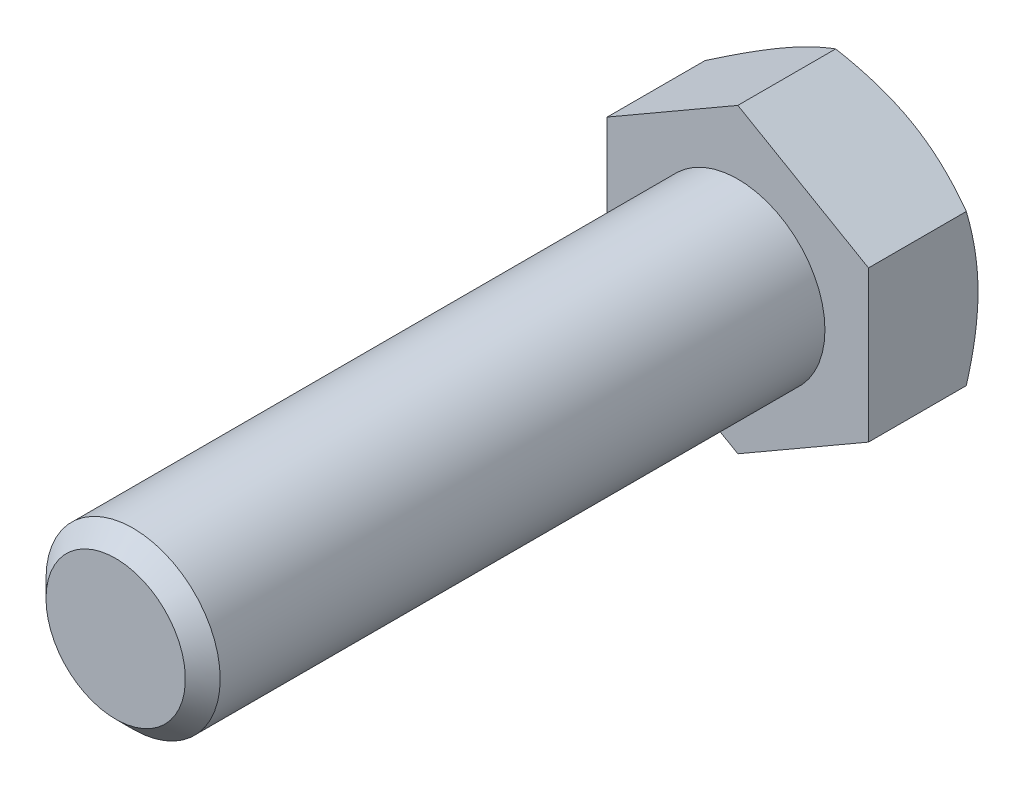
ISO-10303-21;
HEADER;
FILE_DESCRIPTION(('STEP AP214'),'2;1');
FILE_NAME('part.step','',(''),(''),'','','');
FILE_SCHEMA(('AUTOMOTIVE_DESIGN { 1 0 10303 214 1 1 1 1 }'));
ENDSEC;
DATA;
#1=APPLICATION_CONTEXT('core data for automotive mechanical design processes');
#2=APPLICATION_PROTOCOL_DEFINITION('international standard','automotive_design',2000,#1);
#3=PRODUCT_CONTEXT('',#1,'mechanical');
#4=PRODUCT('Part','Part','',(#3));
#5=PRODUCT_RELATED_PRODUCT_CATEGORY('part','',(#4));
#6=PRODUCT_DEFINITION_FORMATION('','',#4);
#7=PRODUCT_DEFINITION_CONTEXT('part definition',#1,'design');
#8=PRODUCT_DEFINITION('design','',#6,#7);
#9=PRODUCT_DEFINITION_SHAPE('','',#8);
#10=(LENGTH_UNIT() NAMED_UNIT(*) SI_UNIT(.MILLI.,.METRE.));
#11=(NAMED_UNIT(*) PLANE_ANGLE_UNIT() SI_UNIT($,.RADIAN.));
#12=(NAMED_UNIT(*) SI_UNIT($,.STERADIAN.) SOLID_ANGLE_UNIT());
#13=UNCERTAINTY_MEASURE_WITH_UNIT(LENGTH_MEASURE(1.E-05),#10,'distance_accuracy_value','');
#14=(GEOMETRIC_REPRESENTATION_CONTEXT(3) GLOBAL_UNCERTAINTY_ASSIGNED_CONTEXT((#13)) GLOBAL_UNIT_ASSIGNED_CONTEXT((#10,
#11,#12)) REPRESENTATION_CONTEXT('',''));
#15=CARTESIAN_POINT('',(0.,0.,0.));
#16=DIRECTION('',(0.,0.,1.));
#17=DIRECTION('',(1.,0.,0.));
#18=AXIS2_PLACEMENT_3D('',#15,#16,#17);
#19=CARTESIAN_POINT('',(0.,0.,50.));
#20=DIRECTION('',(0.,0.,1.));
#21=DIRECTION('',(1.,0.,0.));
#22=AXIS2_PLACEMENT_3D('',#19,#20,#21);
#23=PLANE('',#22);
#24=CARTESIAN_POINT('',(0.,0.,50.));
#25=DIRECTION('',(0.,0.,1.));
#26=DIRECTION('',(1.,0.,0.));
#27=AXIS2_PLACEMENT_3D('',#24,#25,#26);
#28=CIRCLE('',#27,5.60000000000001);
#29=CARTESIAN_POINT('',(-5.6,0.,50.));
#30=VERTEX_POINT('',#29);
#31=EDGE_CURVE('E261',#30,#30,#28,.T.);
#32=ORIENTED_EDGE('',*,*,#31,.T.);
#33=EDGE_LOOP('',(#32));
#34=FACE_BOUND('',#33,.T.);
#35=ADVANCED_FACE('F30',(#34),#23,.T.);
#36=CARTESIAN_POINT('',(0.,0.,0.));
#37=DIRECTION('',(0.,0.,1.));
#38=DIRECTION('',(1.,0.,0.));
#39=AXIS2_PLACEMENT_3D('',#36,#37,#38);
#40=CYLINDRICAL_SURFACE('',#39,7.);
#41=CARTESIAN_POINT('',(0.,0.,48.6));
#42=DIRECTION('',(0.,0.,1.));
#43=DIRECTION('',(1.,0.,0.));
#44=AXIS2_PLACEMENT_3D('',#41,#42,#43);
#45=CIRCLE('',#44,7.);
#46=CARTESIAN_POINT('',(-6.99999999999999,0.,48.6));
#47=VERTEX_POINT('',#46);
#48=EDGE_CURVE('E232',#47,#47,#45,.F.);
#49=ORIENTED_EDGE('',*,*,#48,.T.);
#50=EDGE_LOOP('',(#49));
#51=FACE_BOUND('',#50,.T.);
#52=CARTESIAN_POINT('',(0.,0.,0.));
#53=DIRECTION('',(0.,0.,1.));
#54=DIRECTION('',(1.,0.,0.));
#55=AXIS2_PLACEMENT_3D('',#52,#53,#54);
#56=CIRCLE('',#55,7.);
#57=CARTESIAN_POINT('',(7.,0.,0.));
#58=VERTEX_POINT('',#57);
#59=EDGE_CURVE('E258',#58,#58,#56,.F.);
#60=ORIENTED_EDGE('',*,*,#59,.F.);
#61=EDGE_LOOP('',(#60));
#62=FACE_BOUND('',#61,.T.);
#63=ADVANCED_FACE('F196',(#51,#62),#40,.T.);
#64=CARTESIAN_POINT('',(0.,0.,50.));
#65=DIRECTION('',(0.,0.,-1.));
#66=DIRECTION('',(-1.,0.,0.));
#67=AXIS2_PLACEMENT_3D('',#64,#65,#66);
#68=CONICAL_SURFACE('',#67,5.60000000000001,0.785398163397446);
#69=CARTESIAN_POINT('',(-6.99999999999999,0.,48.6));
#70=CARTESIAN_POINT('',(-6.98541666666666,0.,48.6145833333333));
#71=CARTESIAN_POINT('',(-6.97083333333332,0.,48.6291666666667));
#72=CARTESIAN_POINT('',(-6.94166666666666,0.,48.6583333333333));
#73=CARTESIAN_POINT('',(-6.92708333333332,0.,48.6729166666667));
#74=CARTESIAN_POINT('',(-6.89791666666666,0.,48.7020833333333));
#75=CARTESIAN_POINT('',(-6.88333333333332,0.,48.7166666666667));
#76=CARTESIAN_POINT('',(-6.85416666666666,0.,48.7458333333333));
#77=CARTESIAN_POINT('',(-6.83958333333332,0.,48.7604166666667));
#78=CARTESIAN_POINT('',(-6.81041666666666,0.,48.7895833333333));
#79=CARTESIAN_POINT('',(-6.79583333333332,0.,48.8041666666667));
#80=CARTESIAN_POINT('',(-6.76666666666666,0.,48.8333333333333));
#81=CARTESIAN_POINT('',(-6.75208333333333,0.,48.8479166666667));
#82=CARTESIAN_POINT('',(-6.72291666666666,0.,48.8770833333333));
#83=CARTESIAN_POINT('',(-6.70833333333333,0.,48.8916666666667));
#84=CARTESIAN_POINT('',(-6.67916666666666,0.,48.9208333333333));
#85=CARTESIAN_POINT('',(-6.66458333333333,0.,48.9354166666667));
#86=CARTESIAN_POINT('',(-6.63541666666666,0.,48.9645833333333));
#87=CARTESIAN_POINT('',(-6.62083333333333,0.,48.9791666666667));
#88=CARTESIAN_POINT('',(-6.59166666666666,0.,49.0083333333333));
#89=CARTESIAN_POINT('',(-6.57708333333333,0.,49.0229166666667));
#90=CARTESIAN_POINT('',(-6.54791666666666,0.,49.0520833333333));
#91=CARTESIAN_POINT('',(-6.53333333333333,0.,49.0666666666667));
#92=CARTESIAN_POINT('',(-6.50416666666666,0.,49.0958333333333));
#93=CARTESIAN_POINT('',(-6.48958333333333,0.,49.1104166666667));
#94=CARTESIAN_POINT('',(-6.46041666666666,0.,49.1395833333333));
#95=CARTESIAN_POINT('',(-6.44583333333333,0.,49.1541666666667));
#96=CARTESIAN_POINT('',(-6.41666666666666,0.,49.1833333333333));
#97=CARTESIAN_POINT('',(-6.40208333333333,0.,49.1979166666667));
#98=CARTESIAN_POINT('',(-6.37291666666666,0.,49.2270833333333));
#99=CARTESIAN_POINT('',(-6.35833333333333,0.,49.2416666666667));
#100=CARTESIAN_POINT('',(-6.32916666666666,0.,49.2708333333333));
#101=CARTESIAN_POINT('',(-6.31458333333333,0.,49.2854166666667));
#102=CARTESIAN_POINT('',(-6.28541666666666,0.,49.3145833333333));
#103=CARTESIAN_POINT('',(-6.27083333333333,0.,49.3291666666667));
#104=CARTESIAN_POINT('',(-6.24166666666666,0.,49.3583333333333));
#105=CARTESIAN_POINT('',(-6.22708333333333,0.,49.3729166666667));
#106=CARTESIAN_POINT('',(-6.19791666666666,0.,49.4020833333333));
#107=CARTESIAN_POINT('',(-6.18333333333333,0.,49.4166666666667));
#108=CARTESIAN_POINT('',(-6.15416666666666,0.,49.4458333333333));
#109=CARTESIAN_POINT('',(-6.13958333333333,0.,49.4604166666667));
#110=CARTESIAN_POINT('',(-6.11041666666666,0.,49.4895833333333));
#111=CARTESIAN_POINT('',(-6.09583333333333,0.,49.5041666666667));
#112=CARTESIAN_POINT('',(-6.06666666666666,0.,49.5333333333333));
#113=CARTESIAN_POINT('',(-6.05208333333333,0.,49.5479166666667));
#114=CARTESIAN_POINT('',(-6.02291666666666,0.,49.5770833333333));
#115=CARTESIAN_POINT('',(-6.00833333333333,0.,49.5916666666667));
#116=CARTESIAN_POINT('',(-5.97916666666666,0.,49.6208333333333));
#117=CARTESIAN_POINT('',(-5.96458333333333,0.,49.6354166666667));
#118=CARTESIAN_POINT('',(-5.93541666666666,0.,49.6645833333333));
#119=CARTESIAN_POINT('',(-5.92083333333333,0.,49.6791666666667));
#120=CARTESIAN_POINT('',(-5.89166666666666,0.,49.7083333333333));
#121=CARTESIAN_POINT('',(-5.87708333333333,0.,49.7229166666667));
#122=CARTESIAN_POINT('',(-5.84791666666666,0.,49.7520833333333));
#123=CARTESIAN_POINT('',(-5.83333333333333,0.,49.7666666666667));
#124=CARTESIAN_POINT('',(-5.80416666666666,0.,49.7958333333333));
#125=CARTESIAN_POINT('',(-5.78958333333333,0.,49.8104166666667));
#126=CARTESIAN_POINT('',(-5.76041666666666,0.,49.8395833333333));
#127=CARTESIAN_POINT('',(-5.74583333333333,0.,49.8541666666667));
#128=CARTESIAN_POINT('',(-5.71666666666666,0.,49.8833333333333));
#129=CARTESIAN_POINT('',(-5.70208333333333,0.,49.8979166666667));
#130=CARTESIAN_POINT('',(-5.67291666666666,0.,49.9270833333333));
#131=CARTESIAN_POINT('',(-5.65833333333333,0.,49.9416666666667));
#132=CARTESIAN_POINT('',(-5.62916666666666,0.,49.9708333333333));
#133=CARTESIAN_POINT('',(-5.61458333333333,0.,49.9854166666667));
#134=CARTESIAN_POINT('',(-5.6,0.,50.));
#135=B_SPLINE_CURVE_WITH_KNOTS('',3,(#69,#70,#71,#72,#73,#74,#75,#76,#77,#78,#79,#80,#81,#82,
#83,#84,#85,#86,#87,#88,#89,#90,#91,#92,#93,#94,#95,#96,#97,#98,#99,#100,#101,#102,#103,#104,
#105,#106,#107,#108,#109,#110,#111,#112,#113,#114,#115,#116,#117,#118,#119,#120,#121,#122,#123,
#124,#125,#126,#127,#128,#129,#130,#131,#132,#133,#134),.UNSPECIFIED.,.F.,.F.,(4,2,2,2,2,2,2,2,
2,2,2,2,2,2,2,2,2,2,2,2,2,2,2,2,2,2,2,2,2,2,2,2,4),(0.,0.0618718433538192,0.123743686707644,
0.185615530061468,0.247487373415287,0.309359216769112,0.371231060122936,0.433102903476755,
0.49497474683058,0.556846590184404,0.618718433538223,0.680590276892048,0.742462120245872,
0.804333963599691,0.866205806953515,0.92807765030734,0.989949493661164,1.05182133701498,
1.11369318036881,1.17556502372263,1.23743686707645,1.29930871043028,1.3611805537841,
1.42305239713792,1.48492424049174,1.54679608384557,1.60866792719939,1.67053977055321,
1.73241161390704,1.79428345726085,1.85615530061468,1.9180271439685,1.97989898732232),.UNSPECIFIED.);
#136=EDGE_CURVE('BSEAM32',#47,#30,#135,.T.);
#137=ORIENTED_EDGE('',*,*,#48,.F.);
#138=ORIENTED_EDGE('',*,*,#31,.F.);
#139=ORIENTED_EDGE('',*,*,#136,.T.);
#140=ORIENTED_EDGE('',*,*,#136,.F.);
#141=EDGE_LOOP('',(#137,#139,#138,#140));
#142=FACE_BOUND('',#141,.T.);
#143=ADVANCED_FACE('F32',(#142),#68,.T.);
#144=CARTESIAN_POINT('',(0.,12.1243556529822,-8.8));
#145=DIRECTION('',(0.499999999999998,0.86602540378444,0.));
#146=DIRECTION('',(-0.86602540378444,0.499999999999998,0.));
#147=AXIS2_PLACEMENT_3D('',#144,#145,#146);
#148=PLANE('',#147);
#149=CARTESIAN_POINT('',(-0.000200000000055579,12.124471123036,-7.86211115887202));
#150=CARTESIAN_POINT('',(0.230612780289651,11.9912113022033,-7.93903608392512));
#151=CARTESIAN_POINT('',(0.462286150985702,11.8574546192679,-8.0124696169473));
#152=CARTESIAN_POINT('',(0.92749073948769,11.588868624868,-8.15138514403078));
#153=CARTESIAN_POINT('',(1.161022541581,11.4540389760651,-8.21686452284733));
#154=CARTESIAN_POINT('',(1.86538084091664,11.0473775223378,-8.40010423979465));
#155=CARTESIAN_POINT('',(2.33898788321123,10.7739403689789,-8.50433004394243));
#156=CARTESIAN_POINT('',(3.04771913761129,10.3647541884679,-8.62654435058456));
#157=CARTESIAN_POINT('',(3.28072597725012,10.2302276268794,-8.66135857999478));
#158=CARTESIAN_POINT('',(3.7478184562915,9.9605516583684,-8.71973973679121));
#159=CARTESIAN_POINT('',(3.98190411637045,9.82540223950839,-8.74330644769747));
#160=CARTESIAN_POINT('',(4.45046590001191,9.55487796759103,-8.77858873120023));
#161=CARTESIAN_POINT('',(4.68494122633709,9.41950357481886,-8.79031838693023));
#162=CARTESIAN_POINT('',(5.15410845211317,9.14862975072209,-8.80167731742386));
#163=CARTESIAN_POINT('',(5.38880034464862,9.01313032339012,-8.80130696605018));
#164=CARTESIAN_POINT('',(5.82756124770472,8.7598115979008,-8.78930773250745));
#165=CARTESIAN_POINT('',(6.03166122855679,8.64197441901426,-8.77914260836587));
#166=CARTESIAN_POINT('',(6.43938384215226,8.40657565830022,-8.74985839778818));
#167=CARTESIAN_POINT('',(6.64300644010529,8.28901409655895,-8.73073867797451));
#168=CARTESIAN_POINT('',(7.25308524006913,7.93678493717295,-8.6603996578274));
#169=CARTESIAN_POINT('',(7.65846156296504,7.70274080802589,-8.59620926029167));
#170=CARTESIAN_POINT('',(8.47351422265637,7.23216993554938,-8.43573291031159));
#171=CARTESIAN_POINT('',(8.88308654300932,6.99570324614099,-8.33876673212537));
#172=CARTESIAN_POINT('',(9.69612354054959,6.52629611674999,-8.11869386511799));
#173=CARTESIAN_POINT('',(10.0995986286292,6.29334966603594,-7.9956388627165));
#174=CARTESIAN_POINT('',(10.5002,6.06206235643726,-7.86211115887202));
#175=B_SPLINE_CURVE_WITH_KNOTS('',3,(#149,#150,#151,#152,#153,#154,#155,#156,#157,#158,#159,
#160,#161,#162,#163,#164,#165,#166,#167,#168,#169,#170,#171,#172,#173,#174),.UNSPECIFIED.,.F.,
.F.,(4,2,2,2,2,2,2,2,2,2,2,2,4),(0.,0.832130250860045,1.66453336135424,3.33288308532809,
4.1465822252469,4.96029702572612,5.77304256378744,6.58576298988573,7.29326708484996,
8.0008212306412,9.41693497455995,10.8644544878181,12.3091325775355),.UNSPECIFIED.);
#176=CARTESIAN_POINT('',(0.,12.1243556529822,-7.86217782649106));
#177=VERTEX_POINT('',#176);
#178=CARTESIAN_POINT('',(5.24999999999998,9.09326673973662,-8.8));
#179=VERTEX_POINT('',#178);
#180=EDGE_CURVE('E220',#177,#179,#175,.T.);
#181=ORIENTED_EDGE('',*,*,#180,.F.);
#182=DIRECTION('',(0.,0.,1.));
#183=VECTOR('',#182,1.);
#184=CARTESIAN_POINT('',(0.,12.1243556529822,-8.8));
#185=LINE('',#184,#183);
#186=CARTESIAN_POINT('',(0.,12.1243556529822,0.));
#187=VERTEX_POINT('',#186);
#188=EDGE_CURVE('E217',#177,#187,#185,.T.);
#189=ORIENTED_EDGE('',*,*,#188,.T.);
#190=DIRECTION('',(-0.86602540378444,0.499999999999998,0.));
#191=VECTOR('',#190,1.);
#192=CARTESIAN_POINT('',(0.,12.1243556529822,0.));
#193=LINE('',#192,#191);
#194=CARTESIAN_POINT('',(10.5,6.06217782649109,0.));
#195=VERTEX_POINT('',#194);
#196=EDGE_CURVE('E225',#195,#187,#193,.T.);
#197=ORIENTED_EDGE('',*,*,#196,.F.);
#198=DIRECTION('',(0.,0.,1.));
#199=VECTOR('',#198,1.);
#200=CARTESIAN_POINT('',(10.5,6.06217782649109,-8.8));
#201=LINE('',#200,#199);
#202=CARTESIAN_POINT('',(10.5,6.0621778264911,-7.86217782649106));
#203=VERTEX_POINT('',#202);
#204=EDGE_CURVE('E250',#203,#195,#201,.T.);
#205=ORIENTED_EDGE('',*,*,#204,.F.);
#206=EDGE_CURVE('E170',#179,#203,#175,.T.);
#207=ORIENTED_EDGE('',*,*,#206,.F.);
#208=EDGE_LOOP('',(#181,#189,#197,#205,#207));
#209=FACE_BOUND('',#208,.T.);
#210=ADVANCED_FACE('F180',(#209),#148,.T.);
#211=CARTESIAN_POINT('',(10.5,-6.06217782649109,-8.8));
#212=DIRECTION('',(1.,0.,0.));
#213=DIRECTION('',(0.,0.,-1.));
#214=AXIS2_PLACEMENT_3D('',#211,#212,#213);
#215=PLANE('',#214);
#216=CARTESIAN_POINT('',(10.5,-16.5629789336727,-3.53989491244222));
#217=CARTESIAN_POINT('',(10.5,-16.3324493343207,-3.65230404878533));
#218=CARTESIAN_POINT('',(10.5,-16.1016566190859,-3.76417333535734));
#219=CARTESIAN_POINT('',(10.5,-15.6394901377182,-3.98671045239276));
#220=CARTESIAN_POINT('',(10.5,-15.4081163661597,-4.09737827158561));
#221=CARTESIAN_POINT('',(10.5,-14.712983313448,-4.42742432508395));
#222=CARTESIAN_POINT('',(10.5,-14.248276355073,-4.64481383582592));
#223=CARTESIAN_POINT('',(10.5,-13.3134466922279,-5.07413775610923));
#224=CARTESIAN_POINT('',(10.5,-12.8433084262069,-5.2860383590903));
#225=CARTESIAN_POINT('',(10.5,-11.8993888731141,-5.70153466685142));
#226=CARTESIAN_POINT('',(10.5,-11.4256077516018,-5.90513074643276));
#227=CARTESIAN_POINT('',(10.5,-10.4574367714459,-6.30858523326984));
#228=CARTESIAN_POINT('',(10.5,-9.96289464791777,-6.50808008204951));
#229=CARTESIAN_POINT('',(10.5,-8.96812552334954,-6.89263703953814));
#230=CARTESIAN_POINT('',(10.5,-8.46789790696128,-7.07769756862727));
#231=CARTESIAN_POINT('',(10.5,-7.46182642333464,-7.42872878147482));
#232=CARTESIAN_POINT('',(10.5,-6.95599532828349,-7.59473578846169));
#233=CARTESIAN_POINT('',(10.5,-5.93703641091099,-7.90252989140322));
#234=CARTESIAN_POINT('',(10.5,-5.42391085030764,-8.0443243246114));
#235=CARTESIAN_POINT('',(10.5,-4.65004411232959,-8.23348309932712));
#236=CARTESIAN_POINT('',(10.5,-4.39213073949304,-8.29247932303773));
#237=CARTESIAN_POINT('',(10.5,-3.87449212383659,-8.40194855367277));
#238=CARTESIAN_POINT('',(10.5,-3.61476691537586,-8.45242172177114));
#239=CARTESIAN_POINT('',(10.5,-3.09366450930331,-8.54397190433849));
#240=CARTESIAN_POINT('',(10.5,-2.83228735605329,-8.58504917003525));
#241=CARTESIAN_POINT('',(10.5,-2.30813350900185,-8.65699998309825));
#242=CARTESIAN_POINT('',(10.5,-2.04535687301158,-8.68787394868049));
#243=CARTESIAN_POINT('',(10.5,-1.5223239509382,-8.7384014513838));
#244=CARTESIAN_POINT('',(10.5,-1.26208192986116,-8.75820173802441));
#245=CARTESIAN_POINT('',(10.5,-0.740993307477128,-8.78676818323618));
#246=CARTESIAN_POINT('',(10.5,-0.480146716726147,-8.79553453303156));
#247=CARTESIAN_POINT('',(10.5,0.0416860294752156,-8.80182303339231));
#248=CARTESIAN_POINT('',(10.5,0.302672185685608,-8.79934512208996));
#249=CARTESIAN_POINT('',(10.5,0.824301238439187,-8.78320850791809));
#250=CARTESIAN_POINT('',(10.5,1.08494411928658,-8.76954931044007));
#251=CARTESIAN_POINT('',(10.5,1.70298182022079,-8.72419928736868));
#252=CARTESIAN_POINT('',(10.5,2.0600298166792,-8.68766932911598));
#253=CARTESIAN_POINT('',(10.5,2.77164016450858,-8.59555782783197));
#254=CARTESIAN_POINT('',(10.5,3.12620220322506,-8.53997393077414));
#255=CARTESIAN_POINT('',(10.5,4.18565161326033,-8.34757543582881));
#256=CARTESIAN_POINT('',(10.5,4.88595752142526,-8.1851428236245));
#257=CARTESIAN_POINT('',(10.5,5.93370494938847,-7.90132203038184));
#258=CARTESIAN_POINT('',(10.5,6.28651822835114,-7.79860514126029));
#259=CARTESIAN_POINT('',(10.5,6.98872323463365,-7.58197095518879));
#260=CARTESIAN_POINT('',(10.5,7.33811493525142,-7.4680535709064));
#261=CARTESIAN_POINT('',(10.5,8.03358066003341,-7.23088999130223));
#262=CARTESIAN_POINT('',(10.5,8.37965557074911,-7.10764637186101));
#263=CARTESIAN_POINT('',(10.5,9.06889903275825,-6.85333339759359));
#264=CARTESIAN_POINT('',(10.5,9.41206765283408,-6.72226422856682));
#265=CARTESIAN_POINT('',(10.5,10.3427918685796,-6.35655861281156));
#266=CARTESIAN_POINT('',(10.5,10.9278216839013,-6.1154998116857));
#267=CARTESIAN_POINT('',(10.5,12.0917802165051,-5.61902471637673));
#268=CARTESIAN_POINT('',(10.5,12.6707082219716,-5.36360676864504));
#269=CARTESIAN_POINT('',(10.5,13.8238790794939,-4.8418421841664));
#270=CARTESIAN_POINT('',(10.5,14.398119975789,-4.5754912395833));
#271=CARTESIAN_POINT('',(10.5,15.542640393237,-4.03450017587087));
#272=CARTESIAN_POINT('',(10.5,16.1129200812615,-3.75986040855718));
#273=CARTESIAN_POINT('',(10.5,17.2512491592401,-3.20365321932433));
#274=CARTESIAN_POINT('',(10.5,17.8192933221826,-2.92207512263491));
#275=CARTESIAN_POINT('',(10.5,18.9528074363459,-2.35378095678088));
#276=CARTESIAN_POINT('',(10.5,19.5182773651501,-2.06706484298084));
#277=CARTESIAN_POINT('',(10.5,20.6469787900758,-1.48957659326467));
#278=CARTESIAN_POINT('',(10.5,21.210210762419,-1.19880538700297));
#279=CARTESIAN_POINT('',(10.5,22.3349267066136,-0.613909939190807));
#280=CARTESIAN_POINT('',(10.5,22.8964106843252,-0.319785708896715));
#281=CARTESIAN_POINT('',(10.5,24.4583663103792,0.503299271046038));
#282=CARTESIAN_POINT('',(10.5,25.4572548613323,1.03526359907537));
#283=CARTESIAN_POINT('',(10.5,27.4516969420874,2.10554559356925));
#284=CARTESIAN_POINT('',(10.5,28.4472502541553,2.64386366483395));
#285=CARTESIAN_POINT('',(10.5,30.4323747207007,3.7233782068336));
#286=CARTESIAN_POINT('',(10.5,31.4219546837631,4.26455848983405));
#287=CARTESIAN_POINT('',(10.5,32.9047991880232,5.07900862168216));
#288=CARTESIAN_POINT('',(10.5,33.3988066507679,5.35092764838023));
#289=CARTESIAN_POINT('',(10.5,34.3863794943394,5.89556593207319));
#290=CARTESIAN_POINT('',(10.5,34.8799448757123,6.16828518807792));
#291=CARTESIAN_POINT('',(10.5,35.3733163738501,6.44135483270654));
#292=B_SPLINE_CURVE_WITH_KNOTS('',3,(#216,#217,#218,#219,#220,#221,#222,#223,#224,#225,#226,
#227,#228,#229,#230,#231,#232,#233,#234,#235,#236,#237,#238,#239,#240,#241,#242,#243,#244,#245,
#246,#247,#248,#249,#250,#251,#252,#253,#254,#255,#256,#257,#258,#259,#260,#261,#262,#263,#264,
#265,#266,#267,#268,#269,#270,#271,#272,#273,#274,#275,#276,#277,#278,#279,#280,#281,#282,#283,
#284,#285,#286,#287,#288,#289,#290,#291),.UNSPECIFIED.,.F.,.F.,(4,2,2,2,2,2,2,2,2,2,2,2,2,2,2,2,
2,2,2,2,2,2,2,2,2,2,2,2,2,2,2,2,2,2,2,2,2,4),(0.,0.769425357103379,1.53885792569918,
3.07793697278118,4.62493168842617,6.17185650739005,7.77147528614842,9.37126887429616,
10.9679601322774,12.5641666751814,13.357773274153,14.1513648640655,14.9449352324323,
15.7384730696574,16.5212293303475,17.303972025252,18.0867190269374,18.8695006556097,
19.9456341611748,21.0219006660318,23.1754668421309,24.2777514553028,25.3800446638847,
26.4820345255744,27.5839982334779,29.4819519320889,31.3801246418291,33.279052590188,
35.1779000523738,37.0798780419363,38.9818725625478,40.8834379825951,42.7849970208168,
46.1800870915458,49.5753946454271,52.9590658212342,54.650765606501,56.3424632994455),.UNSPECIFIED.);
#293=CARTESIAN_POINT('',(10.5,0.,-8.8));
#294=VERTEX_POINT('',#293);
#295=EDGE_CURVE('E168',#203,#294,#292,.F.);
#296=ORIENTED_EDGE('',*,*,#295,.F.);
#297=ORIENTED_EDGE('',*,*,#204,.T.);
#298=DIRECTION('',(0.,1.,0.));
#299=VECTOR('',#298,1.);
#300=CARTESIAN_POINT('',(10.5,-6.06217782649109,0.));
#301=LINE('',#300,#299);
#302=CARTESIAN_POINT('',(10.5,-6.06217782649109,0.));
#303=VERTEX_POINT('',#302);
#304=EDGE_CURVE('E257',#303,#195,#301,.T.);
#305=ORIENTED_EDGE('',*,*,#304,.F.);
#306=DIRECTION('',(0.,0.,1.));
#307=VECTOR('',#306,1.);
#308=CARTESIAN_POINT('',(10.5,-6.06217782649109,-8.8));
#309=LINE('',#308,#307);
#310=CARTESIAN_POINT('',(10.5,-6.06217782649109,-7.86217782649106));
#311=VERTEX_POINT('',#310);
#312=EDGE_CURVE('E235',#311,#303,#309,.T.);
#313=ORIENTED_EDGE('',*,*,#312,.F.);
#314=EDGE_CURVE('E163',#294,#311,#292,.F.);
#315=ORIENTED_EDGE('',*,*,#314,.F.);
#316=EDGE_LOOP('',(#296,#297,#305,#313,#315));
#317=FACE_BOUND('',#316,.T.);
#318=ADVANCED_FACE('F176',(#317),#215,.T.);
#319=CARTESIAN_POINT('',(0.,-12.1243556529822,-8.8));
#320=DIRECTION('',(0.499999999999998,-0.86602540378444,0.));
#321=DIRECTION('',(0.86602540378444,0.499999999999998,0.));
#322=AXIS2_PLACEMENT_3D('',#319,#320,#321);
#323=PLANE('',#322);
#324=CARTESIAN_POINT('',(10.5002,-6.06206235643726,-7.86211115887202));
#325=CARTESIAN_POINT('',(10.2693872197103,-6.19532217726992,-7.93903608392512));
#326=CARTESIAN_POINT('',(10.0377138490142,-6.32907886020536,-8.01246961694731));
#327=CARTESIAN_POINT('',(9.57250926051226,-6.59766485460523,-8.15138514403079));
#328=CARTESIAN_POINT('',(9.33897745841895,-6.73249450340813,-8.21686452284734));
#329=CARTESIAN_POINT('',(8.63461915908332,-7.13915595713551,-8.40010423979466));
#330=CARTESIAN_POINT('',(8.16101211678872,-7.4125931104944,-8.50433004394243));
#331=CARTESIAN_POINT('',(7.45228086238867,-7.82177929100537,-8.62654435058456));
#332=CARTESIAN_POINT('',(7.21927402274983,-7.95630585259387,-8.66135857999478));
#333=CARTESIAN_POINT('',(6.75218154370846,-8.22598182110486,-8.71973973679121));
#334=CARTESIAN_POINT('',(6.5180958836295,-8.36113123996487,-8.74330644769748));
#335=CARTESIAN_POINT('',(6.04953409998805,-8.63165551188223,-8.77858873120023));
#336=CARTESIAN_POINT('',(5.81505877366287,-8.7670299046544,-8.79031838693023));
#337=CARTESIAN_POINT('',(5.34589154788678,-9.03790372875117,-8.80167731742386));
#338=CARTESIAN_POINT('',(5.11119965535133,-9.17340315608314,-8.80130696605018));
#339=CARTESIAN_POINT('',(4.67243875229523,-9.42672188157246,-8.78930773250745));
#340=CARTESIAN_POINT('',(4.46833877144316,-9.544559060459,-8.77914260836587));
#341=CARTESIAN_POINT('',(4.06061615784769,-9.77995782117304,-8.74985839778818));
#342=CARTESIAN_POINT('',(3.85699355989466,-9.89751938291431,-8.73073867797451));
#343=CARTESIAN_POINT('',(3.24691475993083,-10.2497485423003,-8.6603996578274));
#344=CARTESIAN_POINT('',(2.84153843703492,-10.4837926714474,-8.59620926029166));
#345=CARTESIAN_POINT('',(2.02648577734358,-10.9543635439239,-8.43573291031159));
#346=CARTESIAN_POINT('',(1.61691345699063,-11.1908302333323,-8.33876673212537));
#347=CARTESIAN_POINT('',(0.803876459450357,-11.6602373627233,-8.11869386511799));
#348=CARTESIAN_POINT('',(0.400401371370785,-11.8931838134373,-7.99563886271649));
#349=CARTESIAN_POINT('',(-0.000200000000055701,-12.124471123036,-7.86211115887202));
#350=B_SPLINE_CURVE_WITH_KNOTS('',3,(#324,#325,#326,#327,#328,#329,#330,#331,#332,#333,#334,
#335,#336,#337,#338,#339,#340,#341,#342,#343,#344,#345,#346,#347,#348,#349),.UNSPECIFIED.,.F.,
.F.,(4,2,2,2,2,2,2,2,2,2,2,2,4),(0.,0.832130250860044,1.66453336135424,3.33288308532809,
4.1465822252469,4.96029702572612,5.77304256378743,6.58576298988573,7.29326708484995,
8.0008212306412,9.41693497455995,10.8644544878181,12.3091325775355),.UNSPECIFIED.);
#351=CARTESIAN_POINT('',(5.24999999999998,-9.09326673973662,-8.8));
#352=VERTEX_POINT('',#351);
#353=EDGE_CURVE('E169',#311,#352,#350,.T.);
#354=ORIENTED_EDGE('',*,*,#353,.F.);
#355=ORIENTED_EDGE('',*,*,#312,.T.);
#356=DIRECTION('',(0.86602540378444,0.499999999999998,0.));
#357=VECTOR('',#356,1.);
#358=CARTESIAN_POINT('',(0.,-12.1243556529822,0.));
#359=LINE('',#358,#357);
#360=CARTESIAN_POINT('',(0.,-12.1243556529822,0.));
#361=VERTEX_POINT('',#360);
#362=EDGE_CURVE('E246',#361,#303,#359,.T.);
#363=ORIENTED_EDGE('',*,*,#362,.F.);
#364=DIRECTION('',(0.,0.,1.));
#365=VECTOR('',#364,1.);
#366=CARTESIAN_POINT('',(0.,-12.1243556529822,-8.8));
#367=LINE('',#366,#365);
#368=CARTESIAN_POINT('',(0.,-12.1243556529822,-7.86217782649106));
#369=VERTEX_POINT('',#368);
#370=EDGE_CURVE('E245',#369,#361,#367,.T.);
#371=ORIENTED_EDGE('',*,*,#370,.F.);
#372=EDGE_CURVE('E157',#352,#369,#350,.T.);
#373=ORIENTED_EDGE('',*,*,#372,.F.);
#374=EDGE_LOOP('',(#354,#355,#363,#371,#373));
#375=FACE_BOUND('',#374,.T.);
#376=ADVANCED_FACE('F179',(#375),#323,.T.);
#377=CARTESIAN_POINT('',(0.,-12.1243556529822,-8.8));
#378=DIRECTION('',(-0.500000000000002,-0.866025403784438,0.));
#379=DIRECTION('',(0.866025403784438,-0.500000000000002,0.));
#380=AXIS2_PLACEMENT_3D('',#377,#378,#379);
#381=PLANE('',#380);
#382=CARTESIAN_POINT('',(0.000199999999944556,-12.124471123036,-7.86211115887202));
#383=CARTESIAN_POINT('',(-0.230612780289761,-11.9912113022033,-7.93903608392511));
#384=CARTESIAN_POINT('',(-0.462286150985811,-11.8574546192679,-8.0124696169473));
#385=CARTESIAN_POINT('',(-0.927490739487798,-11.588868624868,-8.15138514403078));
#386=CARTESIAN_POINT('',(-1.16102254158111,-11.4540389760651,-8.21686452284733));
#387=CARTESIAN_POINT('',(-1.86538084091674,-11.0473775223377,-8.40010423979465));
#388=CARTESIAN_POINT('',(-2.33898788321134,-10.7739403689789,-8.50433004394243));
#389=CARTESIAN_POINT('',(-3.04771913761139,-10.3647541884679,-8.62654435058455));
#390=CARTESIAN_POINT('',(-3.28072597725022,-10.2302276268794,-8.66135857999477));
#391=CARTESIAN_POINT('',(-3.7478184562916,-9.96055165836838,-8.7197397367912));
#392=CARTESIAN_POINT('',(-3.98190411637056,-9.82540223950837,-8.74330644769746));
#393=CARTESIAN_POINT('',(-4.45046590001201,-9.554877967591,-8.77858873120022));
#394=CARTESIAN_POINT('',(-4.68494122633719,-9.41950357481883,-8.79031838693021));
#395=CARTESIAN_POINT('',(-5.15410845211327,-9.14862975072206,-8.80167731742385));
#396=CARTESIAN_POINT('',(-5.38880034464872,-9.0131303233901,-8.80130696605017));
#397=CARTESIAN_POINT('',(-5.82756124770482,-8.75981159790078,-8.78930773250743));
#398=CARTESIAN_POINT('',(-6.03166122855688,-8.64197441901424,-8.77914260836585));
#399=CARTESIAN_POINT('',(-6.43938384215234,-8.4065756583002,-8.74985839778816));
#400=CARTESIAN_POINT('',(-6.64300644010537,-8.28901409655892,-8.73073867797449));
#401=CARTESIAN_POINT('',(-7.25308524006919,-7.93678493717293,-8.66039965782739));
#402=CARTESIAN_POINT('',(-7.65846156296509,-7.70274080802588,-8.59620926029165));
#403=CARTESIAN_POINT('',(-8.47351422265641,-7.23216993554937,-8.43573291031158));
#404=CARTESIAN_POINT('',(-8.88308654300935,-6.99570324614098,-8.33876673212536));
#405=CARTESIAN_POINT('',(-9.69612354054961,-6.52629611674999,-8.11869386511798));
#406=CARTESIAN_POINT('',(-10.0995986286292,-6.29334966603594,-7.99563886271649));
#407=CARTESIAN_POINT('',(-10.5002,-6.06206235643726,-7.86211115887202));
#408=B_SPLINE_CURVE_WITH_KNOTS('',3,(#382,#383,#384,#385,#386,#387,#388,#389,#390,#391,#392,
#393,#394,#395,#396,#397,#398,#399,#400,#401,#402,#403,#404,#405,#406,#407),.UNSPECIFIED.,.F.,
.F.,(4,2,2,2,2,2,2,2,2,2,2,2,4),(0.,0.832130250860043,1.66453336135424,3.33288308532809,
4.1465822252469,4.96029702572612,5.77304256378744,6.58576298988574,7.29326708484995,
8.00082123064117,9.4169349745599,10.864454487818,12.3091325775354),.UNSPECIFIED.);
#409=CARTESIAN_POINT('',(-5.25000000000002,-9.0932667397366,-8.8));
#410=VERTEX_POINT('',#409);
#411=EDGE_CURVE('E241',#369,#410,#408,.T.);
#412=ORIENTED_EDGE('',*,*,#411,.F.);
#413=ORIENTED_EDGE('',*,*,#370,.T.);
#414=DIRECTION('',(0.866025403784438,-0.500000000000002,0.));
#415=VECTOR('',#414,1.);
#416=CARTESIAN_POINT('',(0.,-12.1243556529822,0.));
#417=LINE('',#416,#415);
#418=CARTESIAN_POINT('',(-10.5,-6.06217782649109,0.));
#419=VERTEX_POINT('',#418);
#420=EDGE_CURVE('E379',#419,#361,#417,.T.);
#421=ORIENTED_EDGE('',*,*,#420,.F.);
#422=DIRECTION('',(0.,0.,1.));
#423=VECTOR('',#422,1.);
#424=CARTESIAN_POINT('',(-10.5,-6.06217782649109,-8.8));
#425=LINE('',#424,#423);
#426=CARTESIAN_POINT('',(-10.5,-6.06217782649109,-7.86217782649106));
#427=VERTEX_POINT('',#426);
#428=EDGE_CURVE('E248',#427,#419,#425,.T.);
#429=ORIENTED_EDGE('',*,*,#428,.F.);
#430=EDGE_CURVE('E107',#410,#427,#408,.T.);
#431=ORIENTED_EDGE('',*,*,#430,.F.);
#432=EDGE_LOOP('',(#412,#413,#421,#429,#431));
#433=FACE_BOUND('',#432,.T.);
#434=ADVANCED_FACE('F185',(#433),#381,.T.);
#435=CARTESIAN_POINT('',(-10.5,-6.06217782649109,-8.8));
#436=DIRECTION('',(-1.,0.,0.));
#437=DIRECTION('',(0.,0.,1.));
#438=AXIS2_PLACEMENT_3D('',#435,#436,#437);
#439=PLANE('',#438);
#440=CARTESIAN_POINT('',(-10.5,-16.5629789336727,-3.53989491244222));
#441=CARTESIAN_POINT('',(-10.5,-16.3324493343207,-3.65230404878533));
#442=CARTESIAN_POINT('',(-10.5,-16.1016566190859,-3.76417333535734));
#443=CARTESIAN_POINT('',(-10.5,-15.6394901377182,-3.98671045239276));
#444=CARTESIAN_POINT('',(-10.5,-15.4081163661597,-4.09737827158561));
#445=CARTESIAN_POINT('',(-10.5,-14.712983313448,-4.42742432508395));
#446=CARTESIAN_POINT('',(-10.5,-14.248276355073,-4.64481383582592));
#447=CARTESIAN_POINT('',(-10.5,-13.3134466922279,-5.07413775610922));
#448=CARTESIAN_POINT('',(-10.5,-12.8433084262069,-5.2860383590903));
#449=CARTESIAN_POINT('',(-10.5,-11.8993888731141,-5.70153466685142));
#450=CARTESIAN_POINT('',(-10.5,-11.4256077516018,-5.90513074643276));
#451=CARTESIAN_POINT('',(-10.5,-10.4574367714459,-6.30858523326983));
#452=CARTESIAN_POINT('',(-10.5,-9.96289464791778,-6.5080800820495));
#453=CARTESIAN_POINT('',(-10.5,-8.96812552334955,-6.89263703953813));
#454=CARTESIAN_POINT('',(-10.5,-8.46789790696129,-7.07769756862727));
#455=CARTESIAN_POINT('',(-10.5,-7.46182642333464,-7.42872878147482));
#456=CARTESIAN_POINT('',(-10.5,-6.9559953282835,-7.59473578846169));
#457=CARTESIAN_POINT('',(-10.5,-5.93703641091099,-7.90252989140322));
#458=CARTESIAN_POINT('',(-10.5,-5.42391085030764,-8.0443243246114));
#459=CARTESIAN_POINT('',(-10.5,-4.65004411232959,-8.23348309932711));
#460=CARTESIAN_POINT('',(-10.5,-4.39213073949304,-8.29247932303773));
#461=CARTESIAN_POINT('',(-10.5,-3.87449212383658,-8.40194855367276));
#462=CARTESIAN_POINT('',(-10.5,-3.61476691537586,-8.45242172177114));
#463=CARTESIAN_POINT('',(-10.5,-3.09366450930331,-8.54397190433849));
#464=CARTESIAN_POINT('',(-10.5,-2.83228735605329,-8.58504917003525));
#465=CARTESIAN_POINT('',(-10.5,-2.30813350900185,-8.65699998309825));
#466=CARTESIAN_POINT('',(-10.5,-2.04535687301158,-8.68787394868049));
#467=CARTESIAN_POINT('',(-10.5,-1.5223239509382,-8.7384014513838));
#468=CARTESIAN_POINT('',(-10.5,-1.26208192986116,-8.75820173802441));
#469=CARTESIAN_POINT('',(-10.5,-0.740993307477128,-8.78676818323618));
#470=CARTESIAN_POINT('',(-10.5,-0.480146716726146,-8.79553453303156));
#471=CARTESIAN_POINT('',(-10.5,0.0416860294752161,-8.80182303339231));
#472=CARTESIAN_POINT('',(-10.5,0.302672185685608,-8.79934512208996));
#473=CARTESIAN_POINT('',(-10.5,0.824301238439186,-8.78320850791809));
#474=CARTESIAN_POINT('',(-10.5,1.08494411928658,-8.76954931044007));
#475=CARTESIAN_POINT('',(-10.5,1.70298182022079,-8.72419928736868));
#476=CARTESIAN_POINT('',(-10.5,2.0600298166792,-8.68766932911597));
#477=CARTESIAN_POINT('',(-10.5,2.77164016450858,-8.59555782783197));
#478=CARTESIAN_POINT('',(-10.5,3.12620220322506,-8.53997393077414));
#479=CARTESIAN_POINT('',(-10.5,4.18565161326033,-8.34757543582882));
#480=CARTESIAN_POINT('',(-10.5,4.88595752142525,-8.1851428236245));
#481=CARTESIAN_POINT('',(-10.5,5.93370494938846,-7.90132203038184));
#482=CARTESIAN_POINT('',(-10.5,6.28651822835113,-7.79860514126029));
#483=CARTESIAN_POINT('',(-10.5,6.98872323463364,-7.5819709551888));
#484=CARTESIAN_POINT('',(-10.5,7.33811493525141,-7.4680535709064));
#485=CARTESIAN_POINT('',(-10.5,8.0335806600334,-7.23088999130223));
#486=CARTESIAN_POINT('',(-10.5,8.3796555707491,-7.10764637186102));
#487=CARTESIAN_POINT('',(-10.5,9.06889903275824,-6.85333339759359));
#488=CARTESIAN_POINT('',(-10.5,9.41206765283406,-6.72226422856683));
#489=CARTESIAN_POINT('',(-10.5,10.3427918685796,-6.35655861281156));
#490=CARTESIAN_POINT('',(-10.5,10.9278216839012,-6.1154998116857));
#491=CARTESIAN_POINT('',(-10.5,12.0917802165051,-5.61902471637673));
#492=CARTESIAN_POINT('',(-10.5,12.6707082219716,-5.36360676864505));
#493=CARTESIAN_POINT('',(-10.5,13.8238790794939,-4.84184218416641));
#494=CARTESIAN_POINT('',(-10.5,14.398119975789,-4.57549123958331));
#495=CARTESIAN_POINT('',(-10.5,15.542640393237,-4.03450017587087));
#496=CARTESIAN_POINT('',(-10.5,16.1129200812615,-3.75986040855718));
#497=CARTESIAN_POINT('',(-10.5,17.25124915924,-3.20365321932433));
#498=CARTESIAN_POINT('',(-10.5,17.8192933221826,-2.92207512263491));
#499=CARTESIAN_POINT('',(-10.5,18.9528074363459,-2.35378095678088));
#500=CARTESIAN_POINT('',(-10.5,19.5182773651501,-2.06706484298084));
#501=CARTESIAN_POINT('',(-10.5,20.6469787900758,-1.48957659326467));
#502=CARTESIAN_POINT('',(-10.5,21.210210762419,-1.19880538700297));
#503=CARTESIAN_POINT('',(-10.5,22.3349267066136,-0.613909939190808));
#504=CARTESIAN_POINT('',(-10.5,22.8964106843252,-0.319785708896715));
#505=CARTESIAN_POINT('',(-10.5,24.4583663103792,0.503299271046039));
#506=CARTESIAN_POINT('',(-10.5,25.4572548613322,1.03526359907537));
#507=CARTESIAN_POINT('',(-10.5,27.4516969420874,2.10554559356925));
#508=CARTESIAN_POINT('',(-10.5,28.4472502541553,2.64386366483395));
#509=CARTESIAN_POINT('',(-10.5,30.4323747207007,3.7233782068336));
#510=CARTESIAN_POINT('',(-10.5,31.4219546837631,4.26455848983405));
#511=CARTESIAN_POINT('',(-10.5,32.9047991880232,5.07900862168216));
#512=CARTESIAN_POINT('',(-10.5,33.3988066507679,5.35092764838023));
#513=CARTESIAN_POINT('',(-10.5,34.3863794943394,5.89556593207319));
#514=CARTESIAN_POINT('',(-10.5,34.8799448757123,6.16828518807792));
#515=CARTESIAN_POINT('',(-10.5,35.3733163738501,6.44135483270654));
#516=B_SPLINE_CURVE_WITH_KNOTS('',3,(#440,#441,#442,#443,#444,#445,#446,#447,#448,#449,#450,
#451,#452,#453,#454,#455,#456,#457,#458,#459,#460,#461,#462,#463,#464,#465,#466,#467,#468,#469,
#470,#471,#472,#473,#474,#475,#476,#477,#478,#479,#480,#481,#482,#483,#484,#485,#486,#487,#488,
#489,#490,#491,#492,#493,#494,#495,#496,#497,#498,#499,#500,#501,#502,#503,#504,#505,#506,#507,
#508,#509,#510,#511,#512,#513,#514,#515),.UNSPECIFIED.,.F.,.F.,(4,2,2,2,2,2,2,2,2,2,2,2,2,2,2,2,
2,2,2,2,2,2,2,2,2,2,2,2,2,2,2,2,2,2,2,2,2,4),(0.,0.769425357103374,1.53885792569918,
3.07793697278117,4.62493168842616,6.17185650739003,7.77147528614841,9.37126887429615,
10.9679601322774,12.5641666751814,13.357773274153,14.1513648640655,14.9449352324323,
15.7384730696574,16.5212293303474,17.303972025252,18.0867190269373,18.8695006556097,
19.9456341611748,21.0219006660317,23.1754668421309,24.2777514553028,25.3800446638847,
26.4820345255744,27.5839982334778,29.4819519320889,31.380124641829,33.279052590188,
35.1779000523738,37.0798780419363,38.9818725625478,40.8834379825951,42.7849970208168,
46.1800870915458,49.5753946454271,52.9590658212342,54.650765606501,56.3424632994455),.UNSPECIFIED.);
#517=CARTESIAN_POINT('',(-10.5,0.,-8.8));
#518=VERTEX_POINT('',#517);
#519=EDGE_CURVE('E102',#427,#518,#516,.T.);
#520=ORIENTED_EDGE('',*,*,#519,.F.);
#521=ORIENTED_EDGE('',*,*,#428,.T.);
#522=DIRECTION('',(0.,-1.,0.));
#523=VECTOR('',#522,1.);
#524=CARTESIAN_POINT('',(-10.5,-6.06217782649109,0.));
#525=LINE('',#524,#523);
#526=CARTESIAN_POINT('',(-10.5,6.06217782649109,0.));
#527=VERTEX_POINT('',#526);
#528=EDGE_CURVE('E381',#527,#419,#525,.T.);
#529=ORIENTED_EDGE('',*,*,#528,.F.);
#530=DIRECTION('',(0.,0.,1.));
#531=VECTOR('',#530,1.);
#532=CARTESIAN_POINT('',(-10.5,6.06217782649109,-8.8));
#533=LINE('',#532,#531);
#534=CARTESIAN_POINT('',(-10.5,6.06217782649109,-7.86217782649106));
#535=VERTEX_POINT('',#534);
#536=EDGE_CURVE('E128',#535,#527,#533,.T.);
#537=ORIENTED_EDGE('',*,*,#536,.F.);
#538=EDGE_CURVE('E111',#518,#535,#516,.T.);
#539=ORIENTED_EDGE('',*,*,#538,.F.);
#540=EDGE_LOOP('',(#520,#521,#529,#537,#539));
#541=FACE_BOUND('',#540,.T.);
#542=ADVANCED_FACE('F126',(#541),#439,.T.);
#543=CARTESIAN_POINT('',(-10.5,6.06217782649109,-8.8));
#544=DIRECTION('',(-0.500000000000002,0.866025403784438,0.));
#545=DIRECTION('',(-0.866025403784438,-0.500000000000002,0.));
#546=AXIS2_PLACEMENT_3D('',#543,#544,#545);
#547=PLANE('',#546);
#548=CARTESIAN_POINT('',(-10.5002,6.06206235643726,-7.86211115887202));
#549=CARTESIAN_POINT('',(-10.2693872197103,6.19532217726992,-7.93903608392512));
#550=CARTESIAN_POINT('',(-10.0377138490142,6.32907886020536,-8.01246961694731));
#551=CARTESIAN_POINT('',(-9.57250926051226,6.59766485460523,-8.15138514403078));
#552=CARTESIAN_POINT('',(-9.33897745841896,6.73249450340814,-8.21686452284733));
#553=CARTESIAN_POINT('',(-8.63461915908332,7.13915595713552,-8.40010423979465));
#554=CARTESIAN_POINT('',(-8.16101211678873,7.41259311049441,-8.50433004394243));
#555=CARTESIAN_POINT('',(-7.45228086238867,7.82177929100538,-8.62654435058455));
#556=CARTESIAN_POINT('',(-7.21927402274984,7.95630585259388,-8.66135857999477));
#557=CARTESIAN_POINT('',(-6.75218154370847,8.22598182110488,-8.7197397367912));
#558=CARTESIAN_POINT('',(-6.51809588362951,8.36113123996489,-8.74330644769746));
#559=CARTESIAN_POINT('',(-6.04953409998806,8.63165551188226,-8.77858873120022));
#560=CARTESIAN_POINT('',(-5.81505877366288,8.76702990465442,-8.79031838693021));
#561=CARTESIAN_POINT('',(-5.34589154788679,9.0379037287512,-8.80167731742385));
#562=CARTESIAN_POINT('',(-5.11119965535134,9.17340315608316,-8.80130696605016));
#563=CARTESIAN_POINT('',(-4.67243875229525,9.42672188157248,-8.78930773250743));
#564=CARTESIAN_POINT('',(-4.46833877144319,9.54455906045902,-8.77914260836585));
#565=CARTESIAN_POINT('',(-4.06061615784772,9.77995782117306,-8.74985839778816));
#566=CARTESIAN_POINT('',(-3.85699355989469,9.89751938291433,-8.73073867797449));
#567=CARTESIAN_POINT('',(-3.24691475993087,10.2497485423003,-8.66039965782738));
#568=CARTESIAN_POINT('',(-2.84153843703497,10.4837926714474,-8.59620926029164));
#569=CARTESIAN_POINT('',(-2.02648577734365,10.9543635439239,-8.43573291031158));
#570=CARTESIAN_POINT('',(-1.61691345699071,11.1908302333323,-8.33876673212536));
#571=CARTESIAN_POINT('',(-0.803876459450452,11.6602373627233,-8.11869386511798));
#572=CARTESIAN_POINT('',(-0.400401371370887,11.8931838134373,-7.99563886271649));
#573=CARTESIAN_POINT('',(0.00019999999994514,12.124471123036,-7.86211115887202));
#574=B_SPLINE_CURVE_WITH_KNOTS('',3,(#548,#549,#550,#551,#552,#553,#554,#555,#556,#557,#558,
#559,#560,#561,#562,#563,#564,#565,#566,#567,#568,#569,#570,#571,#572,#573),.UNSPECIFIED.,.F.,
.F.,(4,2,2,2,2,2,2,2,2,2,2,2,4),(0.,0.832130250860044,1.66453336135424,3.33288308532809,
4.1465822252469,4.96029702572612,5.77304256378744,6.58576298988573,7.29326708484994,
8.00082123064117,9.4169349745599,10.864454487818,12.3091325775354),.UNSPECIFIED.);
#575=CARTESIAN_POINT('',(-5.25000000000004,9.09326673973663,-8.8));
#576=VERTEX_POINT('',#575);
#577=EDGE_CURVE('E117',#535,#576,#574,.T.);
#578=ORIENTED_EDGE('',*,*,#577,.F.);
#579=ORIENTED_EDGE('',*,*,#536,.T.);
#580=DIRECTION('',(-0.866025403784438,-0.500000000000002,0.));
#581=VECTOR('',#580,1.);
#582=CARTESIAN_POINT('',(-10.5,6.06217782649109,0.));
#583=LINE('',#582,#581);
#584=EDGE_CURVE('E227',#187,#527,#583,.T.);
#585=ORIENTED_EDGE('',*,*,#584,.F.);
#586=ORIENTED_EDGE('',*,*,#188,.F.);
#587=EDGE_CURVE('E119',#576,#177,#574,.T.);
#588=ORIENTED_EDGE('',*,*,#587,.F.);
#589=EDGE_LOOP('',(#578,#579,#585,#586,#588));
#590=FACE_BOUND('',#589,.T.);
#591=ADVANCED_FACE('F193',(#590),#547,.T.);
#592=CARTESIAN_POINT('',(10.5,6.06217782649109,0.));
#593=DIRECTION('',(0.,0.,1.));
#594=DIRECTION('',(1.,0.,0.));
#595=AXIS2_PLACEMENT_3D('',#592,#593,#594);
#596=PLANE('',#595);
#597=ORIENTED_EDGE('',*,*,#59,.T.);
#598=EDGE_LOOP('',(#597));
#599=FACE_BOUND('',#598,.T.);
#600=ORIENTED_EDGE('',*,*,#196,.T.);
#601=ORIENTED_EDGE('',*,*,#584,.T.);
#602=ORIENTED_EDGE('',*,*,#528,.T.);
#603=ORIENTED_EDGE('',*,*,#420,.T.);
#604=ORIENTED_EDGE('',*,*,#362,.T.);
#605=ORIENTED_EDGE('',*,*,#304,.T.);
#606=EDGE_LOOP('',(#600,#601,#602,#603,#604,#605));
#607=FACE_BOUND('',#606,.T.);
#608=ADVANCED_FACE('F182',(#599,#607),#596,.T.);
#609=CARTESIAN_POINT('',(0.,0.,0.));
#610=DIRECTION('',(0.,0.,1.));
#611=DIRECTION('',(1.,0.,0.));
#612=AXIS2_PLACEMENT_3D('',#609,#610,#611);
#613=CONICAL_SURFACE('',#612,25.7420471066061,1.0471975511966);
#614=ORIENTED_EDGE('',*,*,#206,.T.);
#615=ORIENTED_EDGE('',*,*,#295,.T.);
#616=CARTESIAN_POINT('',(0.,0.,-8.8));
#617=DIRECTION('',(0.,0.,1.));
#618=DIRECTION('',(1.,0.,0.));
#619=AXIS2_PLACEMENT_3D('',#616,#617,#618);
#620=CIRCLE('',#619,10.5);
#621=EDGE_CURVE('E34',#179,#294,#620,.F.);
#622=ORIENTED_EDGE('',*,*,#621,.F.);
#623=EDGE_LOOP('',(#614,#615,#622));
#624=FACE_BOUND('',#623,.T.);
#625=ADVANCED_FACE('F213',(#624),#613,.T.);
#626=ORIENTED_EDGE('',*,*,#180,.T.);
#627=EDGE_CURVE('E124',#576,#179,#620,.F.);
#628=ORIENTED_EDGE('',*,*,#627,.F.);
#629=ORIENTED_EDGE('',*,*,#587,.T.);
#630=EDGE_LOOP('',(#626,#628,#629));
#631=FACE_BOUND('',#630,.T.);
#632=ADVANCED_FACE('F149',(#631),#613,.T.);
#633=ORIENTED_EDGE('',*,*,#538,.T.);
#634=ORIENTED_EDGE('',*,*,#577,.T.);
#635=CARTESIAN_POINT('',(0.,0.,-8.8));
#636=DIRECTION('',(0.,0.,-1.));
#637=DIRECTION('',(-1.,0.,0.));
#638=AXIS2_PLACEMENT_3D('',#635,#636,#637);
#639=CIRCLE('',#638,10.5);
#640=EDGE_CURVE('E52',#518,#576,#639,.T.);
#641=ORIENTED_EDGE('',*,*,#640,.F.);
#642=EDGE_LOOP('',(#633,#634,#641));
#643=FACE_BOUND('',#642,.T.);
#644=ADVANCED_FACE('F115',(#643),#613,.T.);
#645=ORIENTED_EDGE('',*,*,#430,.T.);
#646=ORIENTED_EDGE('',*,*,#519,.T.);
#647=EDGE_CURVE('E104',#410,#518,#620,.F.);
#648=ORIENTED_EDGE('',*,*,#647,.F.);
#649=EDGE_LOOP('',(#645,#646,#648));
#650=FACE_BOUND('',#649,.T.);
#651=ADVANCED_FACE('F103',(#650),#613,.T.);
#652=ORIENTED_EDGE('',*,*,#372,.T.);
#653=ORIENTED_EDGE('',*,*,#411,.T.);
#654=EDGE_CURVE('E39',#352,#410,#620,.F.);
#655=ORIENTED_EDGE('',*,*,#654,.F.);
#656=EDGE_LOOP('',(#652,#653,#655));
#657=FACE_BOUND('',#656,.T.);
#658=ADVANCED_FACE('F243',(#657),#613,.T.);
#659=ORIENTED_EDGE('',*,*,#314,.T.);
#660=ORIENTED_EDGE('',*,*,#353,.T.);
#661=EDGE_CURVE('E11',#294,#352,#620,.F.);
#662=ORIENTED_EDGE('',*,*,#661,.F.);
#663=EDGE_LOOP('',(#659,#660,#662));
#664=FACE_BOUND('',#663,.T.);
#665=ADVANCED_FACE('F237',(#664),#613,.T.);
#666=CARTESIAN_POINT('',(10.5,6.06217782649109,-8.8));
#667=DIRECTION('',(0.,0.,1.));
#668=DIRECTION('',(1.,0.,0.));
#669=AXIS2_PLACEMENT_3D('',#666,#667,#668);
#670=PLANE('',#669);
#671=ORIENTED_EDGE('',*,*,#621,.T.);
#672=ORIENTED_EDGE('',*,*,#661,.T.);
#673=ORIENTED_EDGE('',*,*,#654,.T.);
#674=ORIENTED_EDGE('',*,*,#647,.T.);
#675=ORIENTED_EDGE('',*,*,#640,.T.);
#676=ORIENTED_EDGE('',*,*,#627,.T.);
#677=EDGE_LOOP('',(#671,#672,#673,#674,#675,#676));
#678=FACE_BOUND('',#677,.T.);
#679=ADVANCED_FACE('F122',(#678),#670,.F.);
#680=CLOSED_SHELL('',(#35,#63,#143,#210,#318,#376,#434,#542,#591,#608,#625,#632,#644,#651,#658,
#665,#679));
#681=MANIFOLD_SOLID_BREP('B2',#680);
#682=ADVANCED_BREP_SHAPE_REPRESENTATION('',(#18,#681),#14);
#683=SHAPE_DEFINITION_REPRESENTATION(#9,#682);
ENDSEC;
END-ISO-10303-21;
